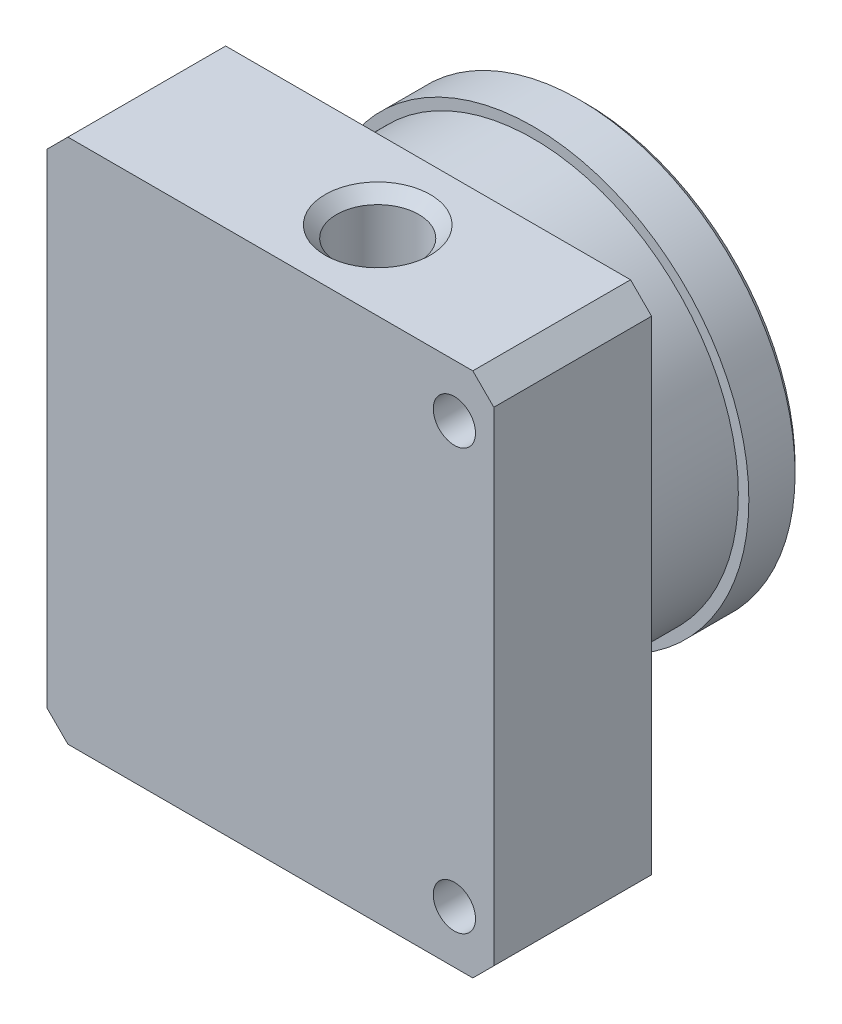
from build123d import *

# Parameters (mm, degrees)
SKETCH1_W                                      = 53.975
SKETCH1_H                                      = 63.5
BODY_DEPTH                                     = 19.05
SKETCH17_R                                     = 2
INTERNAL_PUMP_PORTS_DEPTH                      = 9.525
SKETCH21_R                                     = 26.035
SKETCH21_R_2                                   = 22.225
MOCAP_BOSS_DEPTH                               = 19.05
CHAMFER5_SIZE                                  = 0.762
PUMP_START                                     = -1.27
SKETCH22_R                                     = 22.225
PUMP_POCKET_DEPTH                              = 1.27
BLOCK_CORNERS_SIZE                             = 2.54
INTERNAL_WIRE_POCKET_DEPTH                     = 10.16
SKETCH25_R                                     = 2.5527
MOUNTING_HOLES_DEPTH                           = 46.818011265
SKETCH31_W                                     = 12.7
SKETCH31_H                                     = 1.27
F_7_16_20_TAPPED_HOLE1_OUTLET_PORT_D           = 9.92124
F_7_16_20_TAPPED_HOLE1_OUTLET_PORT_DEPTH       = 12.7
F_7_16_20_TAPPED_HOLE1_OUTLET_PORT_CSINK_D     = 12.7
F_7_16_20_TAPPED_HOLE1_OUTLET_PORT_CSINK_ANGLE = 90
F_7_16_20_TAPPED_HOLE1_OUTLET_PORT_TIP         = 2.980641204
F_7_16_20_TAPPED_HOLE2_INLET_PORT_D            = 9.92124
F_7_16_20_TAPPED_HOLE2_INLET_PORT_DEPTH        = 15.24
F_7_16_20_TAPPED_HOLE2_INLET_PORT_CSINK_D      = 12.7
F_7_16_20_TAPPED_HOLE2_INLET_PORT_CSINK_ANGLE  = 90
F_7_16_20_TAPPED_HOLE2_INLET_PORT_TIP          = 2.980641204
CHAMFER7_SIZE                                  = 0.508
F_7_0_201_INLET_PORT_FLOW_PATH_D               = 4.8514
F_7_0_201_INLET_PORT_FLOW_PATH_DEPTH           = 32.0802
F_7_0_201_INLET_PORT_FLOW_PATH_TIP             = 1.457507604
F_4_40_TAPPED_HOLE1_PUMP_MOUNT_D               = 2.2606
F_4_40_TAPPED_HOLE1_PUMP_MOUNT_DEPTH           = 8.8646
F_4_40_TAPPED_HOLE1_PUMP_MOUNT_CSINK_D         = 4.1148
F_4_40_TAPPED_HOLE1_PUMP_MOUNT_CSINK_ANGLE     = 90
F_4_40_TAPPED_HOLE1_PUMP_MOUNT_TIP             = 0.679152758
F_7_16_20_TAPPED_HOLE3_MCBH_HOLE_D             = 9.92124
F_7_16_20_TAPPED_HOLE3_MCBH_HOLE_DEPTH         = 25.4
F_7_16_20_TAPPED_HOLE3_MCBH_HOLE_CSINK_D       = 12.7
F_7_16_20_TAPPED_HOLE3_MCBH_HOLE_CSINK_ANGLE   = 90
F_7_16_20_TAPPED_HOLE3_MCBH_HOLE_TIP           = 2.980641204
I_0_272_DIAMETER_LURE_COMP_HOLE2_D             = 6.9088
I_0_272_DIAMETER_LURE_COMP_HOLE2_DEPTH         = 26.67
I_0_272_DIAMETER_LURE_COMP_HOLE2_TIP           = 2.075612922
F_11_0_191_OUTLET_FLOW_PATH_D                  = 4.8514
F_11_0_191_OUTLET_FLOW_PATH_DEPTH              = 24.4602
F_11_0_191_OUTLET_FLOW_PATH_TIP                = 1.457507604


with BuildPart() as part:
    # Sketch1 → body (new body)
    with BuildSketch(Plane.XY):
        Rectangle(SKETCH1_W, SKETCH1_H)
    extrude(amount=BODY_DEPTH)

    # Sketch17 → internal pump ports (cut)
    with BuildSketch(Plane(origin=(0, 0, 0), x_dir=(-1, 0, 0), z_dir=(0, 0, -1))):
        with Locations((-3.440462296, 2.872946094)):
            Circle(SKETCH17_R)
        with Locations((3.81, -0.508)):
            Circle(SKETCH17_R)
    extrude(amount=-INTERNAL_PUMP_PORTS_DEPTH, mode=Mode.SUBTRACT)

    # Sketch21 → mocap boss (add)
    with BuildSketch(Plane(origin=(0, 0, 0), x_dir=(-1, 0, 0), z_dir=(0, 0, -1))):
        with Locations(Location((0, 3.175, 0), (0, 0, 180))):
            Circle(SKETCH21_R)
        with Locations(Location((0, 3.175, 0), (0, 0, 180))):
            Circle(SKETCH21_R_2, mode=Mode.SUBTRACT)
    extrude(amount=MOCAP_BOSS_DEPTH)

    # Chamfer5
    chamfer5_edges = [part.edges().sort_by_distance(p)[0] for p in [
        (-26.035, 3.175, -19.05),
        (-22.225, 3.175, -19.05),
    ]]
    chamfer(chamfer5_edges, length=CHAMFER5_SIZE)

    # Sketch22 → pump pocket (cut)
    with BuildSketch(Plane(origin=(0, 0, 0), x_dir=(-1, 0, 0), z_dir=(0, 0, -1)).offset(PUMP_START)):
        with Locations(Location((0, 3.175, 0), (0, 0, 180))):
            Circle(SKETCH22_R)
    extrude(amount=PUMP_POCKET_DEPTH, mode=Mode.SUBTRACT)

    # block corners
    block_corners_edges = [part.edges().sort_by_distance(p)[0] for p in [
        (-26.9875, 31.75, 9.525),
        (26.9875, 31.75, 9.525),
        (26.9875, -31.75, 9.525),
        (-26.9875, -31.75, 9.525),
    ]]
    chamfer(block_corners_edges, length=BLOCK_CORNERS_SIZE)

    # Sketch24 → internal wire pocket (cut)
    with BuildSketch(Plane(origin=(0, 0, 1.27), x_dir=(-1, 0, 0), z_dir=(0, 0, -1))):
        with BuildLine():
            Line((-15.862294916, -1.27), (-8.382, -1.27))
            ThreePointArc((-8.382, -1.27), (-6.047133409, -2.237133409), (-5.08, -4.572))
            Line((-5.08, -4.572), (-5.08, -5.842))
            ThreePointArc((-5.08, -5.842), (-4.112866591, -8.176866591), (-1.778, -9.144))
            Line((-1.778, -9.144), (0.762, -9.144))
            ThreePointArc((0.762, -9.144), (3.096866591, -10.111133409), (4.064, -12.446))
            Line((4.064, -12.446), (4.064, -14.461546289))
            ThreePointArc((4.064, -14.461546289), (3.146727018, -16.745464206), (0.904532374, -17.760468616))
            ThreePointArc((0.904532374, -17.760468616), (-10.713450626, -14.834275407), (-18.829342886, -6.021079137))
            ThreePointArc((-18.829342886, -6.021079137), (-18.663014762, -2.822951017), (-15.862294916, -1.27))
        make_face()
    extrude(amount=-INTERNAL_WIRE_POCKET_DEPTH, mode=Mode.SUBTRACT)

    # Sketch25 → mounting holes (cut, through all)
    with BuildSketch(Plane(origin=(0, 0, 0), x_dir=(-1, 0, 0), z_dir=(0, 0, -1))):
        with Locations((-22.225, 25.4)):
            Circle(SKETCH25_R)
        with Locations((-22.225, -25.4)):
            Circle(SKETCH25_R)
    extrude(amount=-MOUNTING_HOLES_DEPTH, mode=Mode.SUBTRACT)

    # Sketch31 → clamping groove (revolve, cut)
    with BuildSketch(Plane(origin=(0, 0, 0), x_dir=(0, 0, -1), z_dir=(1, 0, 0)), mode=Mode.PRIVATE) as clamping_groove_sk:
        with Locations((6.35, 28.575)):
            Rectangle(SKETCH31_W, SKETCH31_H)
    revolve(clamping_groove_sk.sketch.rotate(Axis((0, 3.175, -55.75532701), (0, 0, 1)), 90), axis=Axis((0, 3.175, -55.75532701), (0, 0, 1)), mode=Mode.SUBTRACT)

    # 7_16-20 Tapped Hole1 outlet port
    with Locations(Plane.ZY.offset(26.9875)):
        with Locations((9.525, -0.508)):
            CounterSinkHole(F_7_16_20_TAPPED_HOLE1_OUTLET_PORT_D / 2, F_7_16_20_TAPPED_HOLE1_OUTLET_PORT_CSINK_D / 2, depth=F_7_16_20_TAPPED_HOLE1_OUTLET_PORT_DEPTH, counter_sink_angle=F_7_16_20_TAPPED_HOLE1_OUTLET_PORT_CSINK_ANGLE)
            with Locations((0, 0, -(F_7_16_20_TAPPED_HOLE1_OUTLET_PORT_DEPTH + F_7_16_20_TAPPED_HOLE1_OUTLET_PORT_TIP / 2))):  # 118° drill point
                Cone(0, F_7_16_20_TAPPED_HOLE1_OUTLET_PORT_D / 2, F_7_16_20_TAPPED_HOLE1_OUTLET_PORT_TIP, mode=Mode.SUBTRACT)

    # 7_16-20 Tapped Hole2 inlet port
    with Locations(Plane(origin=(0, 31.75, 0), x_dir=(-1, 0, 0), z_dir=(0, 1, 0))):
        with Locations((-3.440462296, 9.525)):
            CounterSinkHole(F_7_16_20_TAPPED_HOLE2_INLET_PORT_D / 2, F_7_16_20_TAPPED_HOLE2_INLET_PORT_CSINK_D / 2, depth=F_7_16_20_TAPPED_HOLE2_INLET_PORT_DEPTH, counter_sink_angle=F_7_16_20_TAPPED_HOLE2_INLET_PORT_CSINK_ANGLE)
            with Locations((0, 0, -(F_7_16_20_TAPPED_HOLE2_INLET_PORT_DEPTH + F_7_16_20_TAPPED_HOLE2_INLET_PORT_TIP / 2))):  # 118° drill point
                Cone(0, F_7_16_20_TAPPED_HOLE2_INLET_PORT_D / 2, F_7_16_20_TAPPED_HOLE2_INLET_PORT_TIP, mode=Mode.SUBTRACT)

    # Chamfer7
    chamfer7_edges = [part.edges().sort_by_distance(p)[0] for p in [
        (5.440462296, 2.872946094, 1.27),
        (-1.81, -0.508, 1.27),
    ]]
    chamfer(chamfer7_edges, length=CHAMFER7_SIZE)

    # 7 _0.201_ inlet port flow path
    with Locations(Plane(origin=(0, 31.75, 0), x_dir=(1, 0, 0), z_dir=(0, 1, 0))):
        with Locations((3.440462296, -9.525)):
            Hole(F_7_0_201_INLET_PORT_FLOW_PATH_D / 2, depth=F_7_0_201_INLET_PORT_FLOW_PATH_DEPTH)
            with Locations((0, 0, -(F_7_0_201_INLET_PORT_FLOW_PATH_DEPTH + F_7_0_201_INLET_PORT_FLOW_PATH_TIP / 2))):  # 118° drill point
                Cone(0, F_7_0_201_INLET_PORT_FLOW_PATH_D / 2, F_7_0_201_INLET_PORT_FLOW_PATH_TIP, mode=Mode.SUBTRACT)

    # 4-40 Tapped Hole1 pump mount
    with Locations(Plane(origin=(0, 0, 1.27), x_dir=(-1, 0, 0), z_dir=(0, 0, -1))):
        with Locations((-11.139435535, 11.207561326), (10.602665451, -8.419996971)):
            CounterSinkHole(F_4_40_TAPPED_HOLE1_PUMP_MOUNT_D / 2, F_4_40_TAPPED_HOLE1_PUMP_MOUNT_CSINK_D / 2, depth=F_4_40_TAPPED_HOLE1_PUMP_MOUNT_DEPTH, counter_sink_angle=F_4_40_TAPPED_HOLE1_PUMP_MOUNT_CSINK_ANGLE)
            with Locations((0, 0, -(F_4_40_TAPPED_HOLE1_PUMP_MOUNT_DEPTH + F_4_40_TAPPED_HOLE1_PUMP_MOUNT_TIP / 2))):  # 118° drill point
                Cone(0, F_4_40_TAPPED_HOLE1_PUMP_MOUNT_D / 2, F_4_40_TAPPED_HOLE1_PUMP_MOUNT_TIP, mode=Mode.SUBTRACT)

    # 7_16-20 Tapped Hole3 MCBH hole
    with Locations(Plane(origin=(0, -31.75, 0), x_dir=(-1, 0, 0), z_dir=(0, -1, 0))):
        with Locations((-9.525, -9.525)):
            CounterSinkHole(F_7_16_20_TAPPED_HOLE3_MCBH_HOLE_D / 2, F_7_16_20_TAPPED_HOLE3_MCBH_HOLE_CSINK_D / 2, depth=F_7_16_20_TAPPED_HOLE3_MCBH_HOLE_DEPTH, counter_sink_angle=F_7_16_20_TAPPED_HOLE3_MCBH_HOLE_CSINK_ANGLE)
            with Locations((0, 0, -(F_7_16_20_TAPPED_HOLE3_MCBH_HOLE_DEPTH + F_7_16_20_TAPPED_HOLE3_MCBH_HOLE_TIP / 2))):  # 118° drill point
                Cone(0, F_7_16_20_TAPPED_HOLE3_MCBH_HOLE_D / 2, F_7_16_20_TAPPED_HOLE3_MCBH_HOLE_TIP, mode=Mode.SUBTRACT)

    # I _0.272_ Diameter lure comp Hole2
    with Locations(Plane.ZY.offset(26.9875)):
        with Locations((9.525, -17.78)):
            Hole(I_0_272_DIAMETER_LURE_COMP_HOLE2_D / 2, depth=I_0_272_DIAMETER_LURE_COMP_HOLE2_DEPTH)
            with Locations((0, 0, -(I_0_272_DIAMETER_LURE_COMP_HOLE2_DEPTH + I_0_272_DIAMETER_LURE_COMP_HOLE2_TIP / 2))):  # 118° drill point
                Cone(0, I_0_272_DIAMETER_LURE_COMP_HOLE2_D / 2, I_0_272_DIAMETER_LURE_COMP_HOLE2_TIP, mode=Mode.SUBTRACT)

    # 11 _0.191_ outlet flow path
    with Locations(Plane.ZY.offset(26.9875)):
        with Locations((9.525, -0.508)):
            Hole(F_11_0_191_OUTLET_FLOW_PATH_D / 2, depth=F_11_0_191_OUTLET_FLOW_PATH_DEPTH)
            with Locations((0, 0, -(F_11_0_191_OUTLET_FLOW_PATH_DEPTH + F_11_0_191_OUTLET_FLOW_PATH_TIP / 2))):  # 118° drill point
                Cone(0, F_11_0_191_OUTLET_FLOW_PATH_D / 2, F_11_0_191_OUTLET_FLOW_PATH_TIP, mode=Mode.SUBTRACT)


solid = part.part
